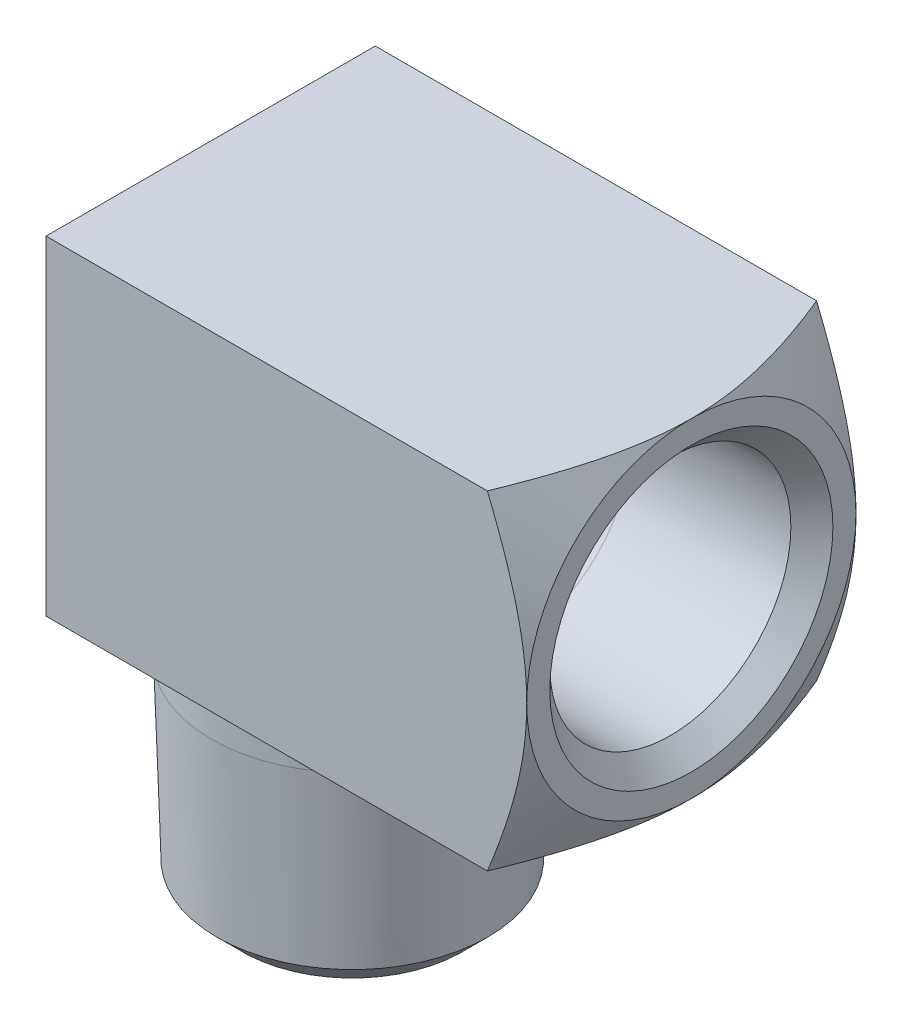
ISO-10303-21;
HEADER;
FILE_DESCRIPTION(('STEP AP214'),'2;1');
FILE_NAME('part.step','',(''),(''),'','','');
FILE_SCHEMA(('AUTOMOTIVE_DESIGN { 1 0 10303 214 1 1 1 1 }'));
ENDSEC;
DATA;
#1=APPLICATION_CONTEXT('core data for automotive mechanical design processes');
#2=APPLICATION_PROTOCOL_DEFINITION('international standard','automotive_design',2000,#1);
#3=PRODUCT_CONTEXT('',#1,'mechanical');
#4=PRODUCT('Part','Part','',(#3));
#5=PRODUCT_RELATED_PRODUCT_CATEGORY('part','',(#4));
#6=PRODUCT_DEFINITION_FORMATION('','',#4);
#7=PRODUCT_DEFINITION_CONTEXT('part definition',#1,'design');
#8=PRODUCT_DEFINITION('design','',#6,#7);
#9=PRODUCT_DEFINITION_SHAPE('','',#8);
#10=(LENGTH_UNIT() NAMED_UNIT(*) SI_UNIT(.MILLI.,.METRE.));
#11=(NAMED_UNIT(*) PLANE_ANGLE_UNIT() SI_UNIT($,.RADIAN.));
#12=(NAMED_UNIT(*) SI_UNIT($,.STERADIAN.) SOLID_ANGLE_UNIT());
#13=UNCERTAINTY_MEASURE_WITH_UNIT(LENGTH_MEASURE(1.E-05),#10,'distance_accuracy_value','');
#14=(GEOMETRIC_REPRESENTATION_CONTEXT(3) GLOBAL_UNCERTAINTY_ASSIGNED_CONTEXT((#13)) GLOBAL_UNIT_ASSIGNED_CONTEXT((#10,
#11,#12)) REPRESENTATION_CONTEXT('',''));
#15=CARTESIAN_POINT('',(0.,0.,0.));
#16=DIRECTION('',(0.,0.,1.));
#17=DIRECTION('',(1.,0.,0.));
#18=AXIS2_PLACEMENT_3D('',#15,#16,#17);
#19=CARTESIAN_POINT('',(0.,16.256,0.));
#20=DIRECTION('',(1.,0.,0.));
#21=DIRECTION('',(0.,0.,1.));
#22=AXIS2_PLACEMENT_3D('',#19,#20,#21);
#23=PLANE('',#22);
#24=CARTESIAN_POINT('',(0.,16.256,0.));
#25=DIRECTION('',(-1.,0.,0.));
#26=DIRECTION('',(0.,0.,-1.));
#27=AXIS2_PLACEMENT_3D('',#24,#25,#26);
#28=CIRCLE('',#27,7.112);
#29=CARTESIAN_POINT('',(-1.26950533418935E-10,16.2560000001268,-7.11199999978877));
#30=VERTEX_POINT('',#29);
#31=CARTESIAN_POINT('',(0.,16.256,7.112));
#32=VERTEX_POINT('',#31);
#33=EDGE_CURVE('E21',#30,#32,#28,.F.);
#34=ORIENTED_EDGE('',*,*,#33,.T.);
#35=DIRECTION('',(0.,0.515038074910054,-0.857167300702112));
#36=VECTOR('',#35,1.);
#37=CARTESIAN_POINT('',(0.,18.3926603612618,3.556));
#38=LINE('',#37,#36);
#39=CARTESIAN_POINT('',(0.,20.5293207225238,0.));
#40=VERTEX_POINT('',#39);
#41=EDGE_CURVE('E70',#32,#40,#38,.T.);
#42=ORIENTED_EDGE('',*,*,#41,.T.);
#43=DIRECTION('',(-3.05900708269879E-11,-0.515038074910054,-0.857167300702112));
#44=VECTOR('',#43,1.);
#45=CARTESIAN_POINT('',(-1.26912369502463E-10,18.3926603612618,-3.556));
#46=LINE('',#45,#44);
#47=EDGE_CURVE('E117',#40,#30,#46,.T.);
#48=ORIENTED_EDGE('',*,*,#47,.T.);
#49=EDGE_LOOP('',(#34,#42,#48));
#50=FACE_BOUND('',#49,.T.);
#51=ADVANCED_FACE('F17',(#50),#23,.T.);
#52=CARTESIAN_POINT('',(26.162,16.256,0.));
#53=DIRECTION('',(-1.,0.,0.));
#54=DIRECTION('',(0.,0.,-1.));
#55=AXIS2_PLACEMENT_3D('',#52,#53,#54);
#56=CYLINDRICAL_SURFACE('',#55,7.112);
#57=CARTESIAN_POINT('',(11.233658,16.256,0.));
#58=DIRECTION('',(-1.,0.,0.));
#59=DIRECTION('',(0.,0.,-1.));
#60=AXIS2_PLACEMENT_3D('',#57,#58,#59);
#61=CIRCLE('',#60,7.112);
#62=CARTESIAN_POINT('',(11.233658,16.256,-7.112));
#63=VERTEX_POINT('',#62);
#64=EDGE_CURVE('E156',#63,#63,#61,.F.);
#65=ORIENTED_EDGE('',*,*,#64,.T.);
#66=EDGE_LOOP('',(#65));
#67=FACE_BOUND('',#66,.T.);
#68=ORIENTED_EDGE('',*,*,#33,.F.);
#69=CARTESIAN_POINT('',(0.,16.256,0.));
#70=DIRECTION('',(-0.707106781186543,-0.707106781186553,0.));
#71=DIRECTION('',(-0.707106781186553,0.707106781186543,0.));
#72=AXIS2_PLACEMENT_3D('',#69,#70,#71);
#73=ELLIPSE('',#72,10.0578868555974,7.112);
#74=EDGE_CURVE('E152',#30,#32,#73,.T.);
#75=ORIENTED_EDGE('',*,*,#74,.T.);
#76=EDGE_LOOP('',(#68,#75));
#77=FACE_BOUND('',#76,.T.);
#78=ADVANCED_FACE('F269',(#67,#77),#56,.F.);
#79=CARTESIAN_POINT('',(0.,16.256,0.));
#80=DIRECTION('',(0.,-1.,0.));
#81=DIRECTION('',(0.,0.,1.));
#82=AXIS2_PLACEMENT_3D('',#79,#80,#81);
#83=CONICAL_SURFACE('',#82,7.112,1.02974425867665);
#84=ORIENTED_EDGE('',*,*,#41,.F.);
#85=CARTESIAN_POINT('',(0.,16.256,0.));
#86=DIRECTION('',(0.,-1.,0.));
#87=DIRECTION('',(0.,0.,1.));
#88=AXIS2_PLACEMENT_3D('',#85,#86,#87);
#89=CIRCLE('',#88,7.112);
#90=EDGE_CURVE('E148',#32,#30,#89,.T.);
#91=ORIENTED_EDGE('',*,*,#90,.T.);
#92=ORIENTED_EDGE('',*,*,#47,.F.);
#93=EDGE_LOOP('',(#84,#91,#92));
#94=FACE_BOUND('',#93,.T.);
#95=ADVANCED_FACE('F275',(#94),#83,.F.);
#96=CARTESIAN_POINT('',(11.2336580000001,7.3266299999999,9.1079574));
#97=DIRECTION('',(-1.,0.,0.));
#98=DIRECTION('',(0.,1.,0.));
#99=AXIS2_PLACEMENT_3D('',#96,#97,#98);
#100=PLANE('',#99);
#101=ORIENTED_EDGE('',*,*,#64,.F.);
#102=EDGE_LOOP('',(#101));
#103=FACE_BOUND('',#102,.T.);
#104=CARTESIAN_POINT('',(11.233658,16.256,0.));
#105=DIRECTION('',(-1.,0.,0.));
#106=DIRECTION('',(0.,0.,-1.));
#107=AXIS2_PLACEMENT_3D('',#104,#105,#106);
#108=CIRCLE('',#107,8.92937);
#109=CARTESIAN_POINT('',(11.233658,16.256,-8.92937));
#110=VERTEX_POINT('',#109);
#111=EDGE_CURVE('E151',#110,#110,#108,.F.);
#112=ORIENTED_EDGE('',*,*,#111,.T.);
#113=EDGE_LOOP('',(#112));
#114=FACE_BOUND('',#113,.T.);
#115=ADVANCED_FACE('F271',(#103,#114),#100,.F.);
#116=CARTESIAN_POINT('',(2.22044604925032E-13,-15.494,0.));
#117=DIRECTION('',(0.,1.,0.));
#118=DIRECTION('',(0.,0.,-1.));
#119=AXIS2_PLACEMENT_3D('',#116,#117,#118);
#120=CYLINDRICAL_SURFACE('',#119,7.112);
#121=CARTESIAN_POINT('',(2.22044604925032E-13,-15.494,0.));
#122=DIRECTION('',(0.,1.,0.));
#123=DIRECTION('',(0.,0.,-1.));
#124=AXIS2_PLACEMENT_3D('',#121,#122,#123);
#125=CIRCLE('',#124,7.112);
#126=CARTESIAN_POINT('',(2.22044604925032E-13,-15.494,-7.112));
#127=VERTEX_POINT('',#126);
#128=EDGE_CURVE('E147',#127,#127,#125,.T.);
#129=ORIENTED_EDGE('',*,*,#128,.F.);
#130=EDGE_LOOP('',(#129));
#131=FACE_BOUND('',#130,.T.);
#132=ORIENTED_EDGE('',*,*,#74,.F.);
#133=ORIENTED_EDGE('',*,*,#90,.F.);
#134=EDGE_LOOP('',(#132,#133));
#135=FACE_BOUND('',#134,.T.);
#136=ADVANCED_FACE('F274',(#131,#135),#120,.F.);
#137=CARTESIAN_POINT('',(12.59078,16.256,0.));
#138=DIRECTION('',(-1.,0.,0.));
#139=DIRECTION('',(0.,0.,-1.));
#140=AXIS2_PLACEMENT_3D('',#137,#138,#139);
#141=CYLINDRICAL_SURFACE('',#140,8.92937);
#142=ORIENTED_EDGE('',*,*,#111,.F.);
#143=EDGE_LOOP('',(#142));
#144=FACE_BOUND('',#143,.T.);
#145=CARTESIAN_POINT('',(12.5907799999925,16.256,0.));
#146=DIRECTION('',(1.,0.,0.));
#147=DIRECTION('',(0.,0.,-1.));
#148=AXIS2_PLACEMENT_3D('',#145,#146,#147);
#149=CIRCLE('',#148,8.9293700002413);
#150=CARTESIAN_POINT('',(12.5907799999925,16.256,-8.9293700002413));
#151=VERTEX_POINT('',#150);
#152=EDGE_CURVE('E144',#151,#151,#149,.T.);
#153=ORIENTED_EDGE('',*,*,#152,.T.);
#154=EDGE_LOOP('',(#153));
#155=FACE_BOUND('',#154,.T.);
#156=ADVANCED_FACE('F19',(#144,#155),#141,.F.);
#157=CARTESIAN_POINT('',(2.22044604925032E-13,-15.494,0.));
#158=DIRECTION('',(0.,-1.,0.));
#159=DIRECTION('',(0.,0.,1.));
#160=AXIS2_PLACEMENT_3D('',#157,#158,#159);
#161=PLANE('',#160);
#162=ORIENTED_EDGE('',*,*,#128,.T.);
#163=EDGE_LOOP('',(#162));
#164=FACE_BOUND('',#163,.T.);
#165=CARTESIAN_POINT('',(2.22044604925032E-13,-15.4940000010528,0.));
#166=DIRECTION('',(0.,1.,0.));
#167=DIRECTION('',(0.,0.,-1.));
#168=AXIS2_PLACEMENT_3D('',#165,#166,#167);
#169=CIRCLE('',#168,8.50900000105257);
#170=CARTESIAN_POINT('',(2.22044604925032E-13,-15.4940000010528,-8.50900000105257));
#171=VERTEX_POINT('',#170);
#172=EDGE_CURVE('E143',#171,#171,#169,.T.);
#173=ORIENTED_EDGE('',*,*,#172,.F.);
#174=EDGE_LOOP('',(#173));
#175=FACE_BOUND('',#174,.T.);
#176=ADVANCED_FACE('F281',(#164,#175),#161,.T.);
#177=CARTESIAN_POINT('',(24.5413835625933,16.256,0.));
#178=DIRECTION('',(1.,0.,0.));
#179=DIRECTION('',(0.,0.,1.));
#180=AXIS2_PLACEMENT_3D('',#177,#178,#179);
#181=CONICAL_SURFACE('',#180,9.30138356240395,0.0311192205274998);
#182=ORIENTED_EDGE('',*,*,#152,.F.);
#183=EDGE_LOOP('',(#182));
#184=FACE_BOUND('',#183,.T.);
#185=CARTESIAN_POINT('',(24.5413835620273,16.256,0.));
#186=DIRECTION('',(1.,0.,0.));
#187=DIRECTION('',(0.,0.,-1.));
#188=AXIS2_PLACEMENT_3D('',#185,#186,#187);
#189=CIRCLE('',#188,9.30138356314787);
#190=CARTESIAN_POINT('',(24.5413835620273,16.256,-9.30138356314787));
#191=VERTEX_POINT('',#190);
#192=EDGE_CURVE('E140',#191,#191,#189,.T.);
#193=ORIENTED_EDGE('',*,*,#192,.T.);
#194=EDGE_LOOP('',(#193));
#195=FACE_BOUND('',#194,.T.);
#196=ADVANCED_FACE('F284',(#184,#195),#181,.F.);
#197=CARTESIAN_POINT('',(2.08166817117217E-13,-13.566791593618,0.));
#198=DIRECTION('',(0.,1.,0.));
#199=DIRECTION('',(0.,0.,-1.));
#200=AXIS2_PLACEMENT_3D('',#197,#198,#199);
#201=CONICAL_SURFACE('',#200,10.4362084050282,0.7853981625);
#202=CARTESIAN_POINT('',(2.08166817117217E-13,-13.5667915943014,0.));
#203=DIRECTION('',(0.,1.,0.));
#204=DIRECTION('',(-1.,0.,0.));
#205=AXIS2_PLACEMENT_3D('',#202,#203,#204);
#206=CIRCLE('',#205,10.4362084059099);
#207=CARTESIAN_POINT('',(-10.4362084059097,-13.5667915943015,0.));
#208=VERTEX_POINT('',#207);
#209=EDGE_CURVE('E136',#208,#208,#206,.T.);
#210=ORIENTED_EDGE('',*,*,#209,.F.);
#211=EDGE_LOOP('',(#210));
#212=FACE_BOUND('',#211,.T.);
#213=ORIENTED_EDGE('',*,*,#172,.T.);
#214=EDGE_LOOP('',(#213));
#215=FACE_BOUND('',#214,.T.);
#216=ADVANCED_FACE('F287',(#212,#215),#201,.T.);
#217=CARTESIAN_POINT('',(26.1620000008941,16.256,0.));
#218=DIRECTION('',(1.,0.,0.));
#219=DIRECTION('',(0.,0.,1.));
#220=AXIS2_PLACEMENT_3D('',#217,#218,#219);
#221=CONICAL_SURFACE('',#220,10.9219999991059,0.785398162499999);
#222=ORIENTED_EDGE('',*,*,#192,.F.);
#223=EDGE_LOOP('',(#222));
#224=FACE_BOUND('',#223,.T.);
#225=CARTESIAN_POINT('',(26.1620000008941,16.256,0.));
#226=DIRECTION('',(1.,0.,0.));
#227=DIRECTION('',(0.,0.,1.));
#228=AXIS2_PLACEMENT_3D('',#225,#226,#227);
#229=CIRCLE('',#228,10.9219999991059);
#230=CARTESIAN_POINT('',(26.1620000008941,16.256,10.9219999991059));
#231=VERTEX_POINT('',#230);
#232=EDGE_CURVE('E139',#231,#231,#229,.T.);
#233=ORIENTED_EDGE('',*,*,#232,.T.);
#234=EDGE_LOOP('',(#233));
#235=FACE_BOUND('',#234,.T.);
#236=ADVANCED_FACE('F291',(#224,#235),#221,.F.);
#237=CARTESIAN_POINT('',(1.14491749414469E-13,-0.123443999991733,0.));
#238=DIRECTION('',(0.,1.,0.));
#239=DIRECTION('',(0.,0.,-1.));
#240=AXIS2_PLACEMENT_3D('',#237,#238,#239);
#241=CONICAL_SURFACE('',#240,10.8546899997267,0.0311192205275);
#242=CARTESIAN_POINT('',(1.14491749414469E-13,-0.123444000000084,0.));
#243=DIRECTION('',(0.,-1.,0.));
#244=DIRECTION('',(0.,0.,1.));
#245=AXIS2_PLACEMENT_3D('',#242,#243,#244);
#246=CIRCLE('',#245,10.85469);
#247=CARTESIAN_POINT('',(1.14491749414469E-13,-0.123444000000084,10.85469));
#248=VERTEX_POINT('',#247);
#249=EDGE_CURVE('E132',#248,#248,#246,.F.);
#250=ORIENTED_EDGE('',*,*,#249,.F.);
#251=EDGE_LOOP('',(#250));
#252=FACE_BOUND('',#251,.T.);
#253=ORIENTED_EDGE('',*,*,#209,.T.);
#254=EDGE_LOOP('',(#253));
#255=FACE_BOUND('',#254,.T.);
#256=ADVANCED_FACE('F294',(#252,#255),#241,.T.);
#257=CARTESIAN_POINT('',(26.162,16.256,0.));
#258=DIRECTION('',(-1.,0.,0.));
#259=DIRECTION('',(0.,0.,-1.));
#260=AXIS2_PLACEMENT_3D('',#257,#258,#259);
#261=PLANE('',#260);
#262=ORIENTED_EDGE('',*,*,#232,.F.);
#263=EDGE_LOOP('',(#262));
#264=FACE_BOUND('',#263,.T.);
#265=CARTESIAN_POINT('',(26.1620000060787,16.256,0.));
#266=DIRECTION('',(-1.,0.,0.));
#267=DIRECTION('',(0.,0.,-1.));
#268=AXIS2_PLACEMENT_3D('',#265,#266,#267);
#269=CIRCLE('',#268,12.7000000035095);
#270=CARTESIAN_POINT('',(26.162000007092,3.55599999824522,0.));
#271=VERTEX_POINT('',#270);
#272=CARTESIAN_POINT('',(26.1620000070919,16.256,12.7000000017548));
#273=VERTEX_POINT('',#272);
#274=EDGE_CURVE('E225',#271,#273,#269,.T.);
#275=ORIENTED_EDGE('',*,*,#274,.F.);
#276=CARTESIAN_POINT('',(26.1620000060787,16.256,0.));
#277=DIRECTION('',(-1.,0.,0.));
#278=DIRECTION('',(0.,0.,-1.));
#279=AXIS2_PLACEMENT_3D('',#276,#277,#278);
#280=CIRCLE('',#279,12.7000000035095);
#281=CARTESIAN_POINT('',(26.1620000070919,16.256,-12.7000000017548));
#282=VERTEX_POINT('',#281);
#283=EDGE_CURVE('E135',#282,#271,#280,.T.);
#284=ORIENTED_EDGE('',*,*,#283,.F.);
#285=CARTESIAN_POINT('',(26.1620000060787,16.256,0.));
#286=DIRECTION('',(-1.,0.,0.));
#287=DIRECTION('',(0.,0.,-1.));
#288=AXIS2_PLACEMENT_3D('',#285,#286,#287);
#289=CIRCLE('',#288,12.7000000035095);
#290=CARTESIAN_POINT('',(26.1620000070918,28.9560000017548,0.));
#291=VERTEX_POINT('',#290);
#292=EDGE_CURVE('E253',#291,#282,#289,.T.);
#293=ORIENTED_EDGE('',*,*,#292,.F.);
#294=CARTESIAN_POINT('',(26.1620000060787,16.256,0.));
#295=DIRECTION('',(-1.,0.,0.));
#296=DIRECTION('',(0.,0.,-1.));
#297=AXIS2_PLACEMENT_3D('',#294,#295,#296);
#298=CIRCLE('',#297,12.7000000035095);
#299=EDGE_CURVE('E206',#273,#291,#298,.T.);
#300=ORIENTED_EDGE('',*,*,#299,.F.);
#301=EDGE_LOOP('',(#275,#284,#293,#300));
#302=FACE_BOUND('',#301,.T.);
#303=ADVANCED_FACE('F213',(#264,#302),#261,.F.);
#304=CARTESIAN_POINT('',(23.1066189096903,16.256,0.));
#305=DIRECTION('',(-1.,0.,0.));
#306=DIRECTION('',(0.,0.,-1.));
#307=AXIS2_PLACEMENT_3D('',#304,#305,#306);
#308=CONICAL_SURFACE('',#307,17.9920752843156,1.04719755);
#309=CARTESIAN_POINT('',(26.1620000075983,28.9559999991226,0.));
#310=CARTESIAN_POINT('',(26.1620046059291,28.9559999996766,-0.183310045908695));
#311=CARTESIAN_POINT('',(26.1597079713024,28.9559999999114,-0.366612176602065));
#312=CARTESIAN_POINT('',(26.1505538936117,28.9560000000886,-0.733097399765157));
#313=CARTESIAN_POINT('',(26.1436965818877,28.9560000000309,-0.916280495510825));
#314=CARTESIAN_POINT('',(26.1163542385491,28.9559999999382,-1.46534509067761));
#315=CARTESIAN_POINT('',(26.0890987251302,28.9559999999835,-1.83090946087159));
#316=CARTESIAN_POINT('',(26.0174746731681,28.9560000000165,-2.55916985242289));
#317=CARTESIAN_POINT('',(25.9731599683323,28.9560000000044,-2.92187127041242));
#318=CARTESIAN_POINT('',(25.868658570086,28.9559999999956,-3.64499769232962));
#319=CARTESIAN_POINT('',(25.808470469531,28.9559999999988,-4.00542249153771));
#320=CARTESIAN_POINT('',(25.6744179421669,28.9560000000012,-4.71984524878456));
#321=CARTESIAN_POINT('',(25.6007012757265,28.9560000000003,-5.07387113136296));
#322=CARTESIAN_POINT('',(25.4407296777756,28.9559999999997,-5.7790486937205));
#323=CARTESIAN_POINT('',(25.3544748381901,28.9559999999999,-6.13020039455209));
#324=CARTESIAN_POINT('',(25.0790888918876,28.9560000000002,-7.17976561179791));
#325=CARTESIAN_POINT('',(24.8734185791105,28.956,-7.87387014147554));
#326=CARTESIAN_POINT('',(24.5385327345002,28.956,-8.91141551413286));
#327=CARTESIAN_POINT('',(24.4216369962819,28.956,-9.25896864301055));
#328=CARTESIAN_POINT('',(24.1804915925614,28.956,-9.95138472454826));
#329=CARTESIAN_POINT('',(24.0562446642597,28.956,-10.2962486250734));
#330=CARTESIAN_POINT('',(23.8006998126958,28.956,-10.9854770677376));
#331=CARTESIAN_POINT('',(23.6693671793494,28.956,-11.3298286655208));
#332=CARTESIAN_POINT('',(23.4010920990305,28.956,-12.0164464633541));
#333=CARTESIAN_POINT('',(23.2641481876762,28.956,-12.3587120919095));
#334=CARTESIAN_POINT('',(23.1248418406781,28.956,-12.699999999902));
#335=B_SPLINE_CURVE_WITH_KNOTS('',3,(#309,#310,#311,#312,#313,#314,#315,#316,#317,#318,#319,
#320,#321,#322,#323,#324,#325,#326,#327,#328,#329,#330,#331,#332,#333,#334),.UNSPECIFIED.,.F.,
.F.,(4,2,2,2,2,2,2,2,2,2,2,2,4),(0.,0.549900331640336,1.09978482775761,2.19905169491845,
3.29487767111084,4.39080082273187,5.47539858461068,6.55998839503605,8.7304468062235,
9.83045639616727,10.9300589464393,12.0356490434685,13.1415295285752),.UNSPECIFIED.);
#336=CARTESIAN_POINT('',(23.1248418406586,28.9559999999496,-12.7));
#337=VERTEX_POINT('',#336);
#338=EDGE_CURVE('E129',#291,#337,#335,.T.);
#339=ORIENTED_EDGE('',*,*,#338,.F.);
#340=ORIENTED_EDGE('',*,*,#292,.T.);
#341=CARTESIAN_POINT('',(23.1248418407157,28.9559999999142,-12.7000000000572));
#342=CARTESIAN_POINT('',(23.2284829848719,28.7021196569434,-12.7000000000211));
#343=CARTESIAN_POINT('',(23.3308012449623,28.447699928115,-12.7000000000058));
#344=CARTESIAN_POINT('',(23.532472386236,27.9376738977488,-12.6999999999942));
#345=CARTESIAN_POINT('',(23.6318251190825,27.6820675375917,-12.699999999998));
#346=CARTESIAN_POINT('',(23.9250334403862,26.9131003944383,-12.700000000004));
#347=CARTESIAN_POINT('',(24.1139396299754,26.3978336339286,-12.7000000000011));
#348=CARTESIAN_POINT('',(24.4735778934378,25.3664445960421,-12.6999999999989));
#349=CARTESIAN_POINT('',(24.6444654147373,24.8503768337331,-12.6999999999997));
#350=CARTESIAN_POINT('',(24.9661448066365,23.8119694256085,-12.7000000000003));
#351=CARTESIAN_POINT('',(25.1169372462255,23.2896299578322,-12.7000000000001));
#352=CARTESIAN_POINT('',(25.3944886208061,22.235493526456,-12.6999999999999));
#353=CARTESIAN_POINT('',(25.5211121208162,21.7036605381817,-12.7));
#354=CARTESIAN_POINT('',(25.7439499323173,20.6337185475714,-12.7));
#355=CARTESIAN_POINT('',(25.8401755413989,20.095611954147,-12.7));
#356=CARTESIAN_POINT('',(25.9582651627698,19.2821403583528,-12.7));
#357=CARTESIAN_POINT('',(25.9933533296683,19.0086601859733,-12.7));
#358=CARTESIAN_POINT('',(26.0539603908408,18.4606364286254,-12.7));
#359=CARTESIAN_POINT('',(26.0794795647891,18.1860928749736,-12.7));
#360=CARTESIAN_POINT('',(26.1205318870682,17.635838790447,-12.7));
#361=CARTESIAN_POINT('',(26.1360498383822,17.360127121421,-12.7));
#362=CARTESIAN_POINT('',(26.1568008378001,16.8082800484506,-12.7));
#363=CARTESIAN_POINT('',(26.1620324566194,16.5321445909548,-12.7));
#364=CARTESIAN_POINT('',(26.162000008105,16.2560000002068,-12.7));
#365=B_SPLINE_CURVE_WITH_KNOTS('',3,(#341,#342,#343,#344,#345,#346,#347,#348,#349,#350,#351,
#352,#353,#354,#355,#356,#357,#358,#359,#360,#361,#362,#363,#364),.UNSPECIFIED.,.F.,.F.,(4,2,2,
2,2,2,2,2,2,2,2,4),(0.,0.822653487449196,1.64534805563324,3.29152221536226,4.92207553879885,
6.55258268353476,8.19197440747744,9.83075612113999,10.6577807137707,11.4847811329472,
12.3130352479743,13.1414044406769),.UNSPECIFIED.);
#366=EDGE_CURVE('E220',#337,#282,#365,.T.);
#367=ORIENTED_EDGE('',*,*,#366,.F.);
#368=EDGE_LOOP('',(#339,#340,#367));
#369=FACE_BOUND('',#368,.T.);
#370=ADVANCED_FACE('F208',(#369),#308,.T.);
#371=CARTESIAN_POINT('',(23.1066189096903,16.256,0.));
#372=DIRECTION('',(-1.,0.,0.));
#373=DIRECTION('',(0.,0.,-1.));
#374=AXIS2_PLACEMENT_3D('',#371,#372,#373);
#375=CONICAL_SURFACE('',#374,17.9920752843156,1.04719755);
#376=CARTESIAN_POINT('',(26.1620000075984,16.256,-12.6999999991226));
#377=CARTESIAN_POINT('',(26.1620046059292,16.0726899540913,-12.6999999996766));
#378=CARTESIAN_POINT('',(26.1597079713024,15.8893878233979,-12.6999999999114));
#379=CARTESIAN_POINT('',(26.1505538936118,15.5229026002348,-12.7000000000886));
#380=CARTESIAN_POINT('',(26.1436965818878,15.3397195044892,-12.7000000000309));
#381=CARTESIAN_POINT('',(26.1163542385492,14.7906549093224,-12.6999999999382));
#382=CARTESIAN_POINT('',(26.0890987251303,14.4250905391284,-12.6999999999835));
#383=CARTESIAN_POINT('',(26.0174746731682,13.6968301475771,-12.7000000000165));
#384=CARTESIAN_POINT('',(25.9731599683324,13.3341287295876,-12.7000000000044));
#385=CARTESIAN_POINT('',(25.8686585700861,12.6110023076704,-12.6999999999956));
#386=CARTESIAN_POINT('',(25.8084704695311,12.2505775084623,-12.6999999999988));
#387=CARTESIAN_POINT('',(25.6744179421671,11.5361547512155,-12.7000000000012));
#388=CARTESIAN_POINT('',(25.6007012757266,11.182128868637,-12.7000000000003));
#389=CARTESIAN_POINT('',(25.4407296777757,10.4769513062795,-12.6999999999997));
#390=CARTESIAN_POINT('',(25.3544748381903,10.1257996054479,-12.6999999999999));
#391=CARTESIAN_POINT('',(25.0790888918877,9.07623438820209,-12.7000000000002));
#392=CARTESIAN_POINT('',(24.8734185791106,8.38212985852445,-12.7));
#393=CARTESIAN_POINT('',(24.5385327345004,7.34458448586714,-12.7));
#394=CARTESIAN_POINT('',(24.421636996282,6.99703135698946,-12.7));
#395=CARTESIAN_POINT('',(24.1804915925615,6.30461527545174,-12.7));
#396=CARTESIAN_POINT('',(24.0562446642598,5.95975137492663,-12.7));
#397=CARTESIAN_POINT('',(23.8006998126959,5.27052293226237,-12.7));
#398=CARTESIAN_POINT('',(23.6693671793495,4.92617133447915,-12.7));
#399=CARTESIAN_POINT('',(23.4010920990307,4.23955353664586,-12.7));
#400=CARTESIAN_POINT('',(23.2641481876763,3.89728790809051,-12.7));
#401=CARTESIAN_POINT('',(23.1248418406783,3.55600000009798,-12.7));
#402=B_SPLINE_CURVE_WITH_KNOTS('',3,(#376,#377,#378,#379,#380,#381,#382,#383,#384,#385,#386,
#387,#388,#389,#390,#391,#392,#393,#394,#395,#396,#397,#398,#399,#400,#401),.UNSPECIFIED.,.F.,
.F.,(4,2,2,2,2,2,2,2,2,2,2,2,4),(0.,0.549900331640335,1.09978482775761,2.19905169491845,
3.29487767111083,4.39080082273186,5.47539858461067,6.55998839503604,8.73044680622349,
9.83045639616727,10.9300589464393,12.0356490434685,13.1415295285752),.UNSPECIFIED.);
#403=CARTESIAN_POINT('',(23.1248418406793,3.55600000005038,-12.6999999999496));
#404=VERTEX_POINT('',#403);
#405=EDGE_CURVE('E95',#282,#404,#402,.T.);
#406=ORIENTED_EDGE('',*,*,#405,.F.);
#407=ORIENTED_EDGE('',*,*,#283,.T.);
#408=CARTESIAN_POINT('',(23.124841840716,3.55599999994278,-12.6999999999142));
#409=CARTESIAN_POINT('',(23.2284829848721,3.5559999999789,-12.4461196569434));
#410=CARTESIAN_POINT('',(23.3308012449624,3.55599999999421,-12.191699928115));
#411=CARTESIAN_POINT('',(23.5324723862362,3.55600000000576,-11.6816738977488));
#412=CARTESIAN_POINT('',(23.6318251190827,3.556000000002,-11.4260675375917));
#413=CARTESIAN_POINT('',(23.9250334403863,3.55599999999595,-10.6571003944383));
#414=CARTESIAN_POINT('',(24.1139396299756,3.55599999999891,-10.1418336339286));
#415=CARTESIAN_POINT('',(24.473577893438,3.55600000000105,-9.11044459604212));
#416=CARTESIAN_POINT('',(24.6444654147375,3.55600000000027,-8.59437683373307));
#417=CARTESIAN_POINT('',(24.9661448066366,3.55599999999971,-7.55596942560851));
#418=CARTESIAN_POINT('',(25.1169372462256,3.55599999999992,-7.03362995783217));
#419=CARTESIAN_POINT('',(25.3944886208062,3.55600000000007,-5.97949352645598));
#420=CARTESIAN_POINT('',(25.5211121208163,3.55600000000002,-5.44766053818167));
#421=CARTESIAN_POINT('',(25.7439499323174,3.55599999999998,-4.37771854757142));
#422=CARTESIAN_POINT('',(25.840175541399,3.55599999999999,-3.83961195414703));
#423=CARTESIAN_POINT('',(25.9582651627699,3.556,-3.02614035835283));
#424=CARTESIAN_POINT('',(25.9933533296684,3.556,-2.75266018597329));
#425=CARTESIAN_POINT('',(26.0539603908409,3.556,-2.20463642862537));
#426=CARTESIAN_POINT('',(26.0794795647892,3.556,-1.93009287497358));
#427=CARTESIAN_POINT('',(26.1205318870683,3.556,-1.37983879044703));
#428=CARTESIAN_POINT('',(26.1360498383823,3.556,-1.10412712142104));
#429=CARTESIAN_POINT('',(26.1568008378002,3.556,-0.552280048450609));
#430=CARTESIAN_POINT('',(26.1620324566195,3.556,-0.276144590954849));
#431=CARTESIAN_POINT('',(26.1620000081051,3.556,-2.06802635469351E-10));
#432=B_SPLINE_CURVE_WITH_KNOTS('',3,(#408,#409,#410,#411,#412,#413,#414,#415,#416,#417,#418,
#419,#420,#421,#422,#423,#424,#425,#426,#427,#428,#429,#430,#431),.UNSPECIFIED.,.F.,.F.,(4,2,2,
2,2,2,2,2,2,2,2,4),(0.,0.822653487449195,1.64534805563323,3.29152221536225,4.92207553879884,
6.55258268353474,8.19197440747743,9.83075612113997,10.6577807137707,11.4847811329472,
12.3130352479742,13.1414044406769),.UNSPECIFIED.);
#433=EDGE_CURVE('E194',#404,#271,#432,.T.);
#434=ORIENTED_EDGE('',*,*,#433,.F.);
#435=EDGE_LOOP('',(#406,#407,#434));
#436=FACE_BOUND('',#435,.T.);
#437=ADVANCED_FACE('F212',(#436),#375,.T.);
#438=CARTESIAN_POINT('',(0.,3.55599999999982,0.));
#439=DIRECTION('',(0.,-1.,0.));
#440=DIRECTION('',(0.,0.,1.));
#441=AXIS2_PLACEMENT_3D('',#438,#439,#440);
#442=CYLINDRICAL_SURFACE('',#441,10.85469);
#443=ORIENTED_EDGE('',*,*,#249,.T.);
#444=EDGE_LOOP('',(#443));
#445=FACE_BOUND('',#444,.T.);
#446=CARTESIAN_POINT('',(0.,3.55599999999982,0.));
#447=DIRECTION('',(0.,-1.,0.));
#448=DIRECTION('',(0.,0.,1.));
#449=AXIS2_PLACEMENT_3D('',#446,#447,#448);
#450=CIRCLE('',#449,10.85469);
#451=CARTESIAN_POINT('',(0.,3.55599999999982,10.85469));
#452=VERTEX_POINT('',#451);
#453=EDGE_CURVE('E99',#452,#452,#450,.F.);
#454=ORIENTED_EDGE('',*,*,#453,.F.);
#455=EDGE_LOOP('',(#454));
#456=FACE_BOUND('',#455,.T.);
#457=ADVANCED_FACE('F232',(#445,#456),#442,.T.);
#458=CARTESIAN_POINT('',(26.162,3.556,-12.7));
#459=DIRECTION('',(0.,0.,-1.));
#460=DIRECTION('',(1.,0.,0.));
#461=AXIS2_PLACEMENT_3D('',#458,#459,#460);
#462=PLANE('',#461);
#463=DIRECTION('',(-1.,0.,0.));
#464=VECTOR('',#463,1.);
#465=CARTESIAN_POINT('',(26.162,28.956,-12.7));
#466=LINE('',#465,#464);
#467=CARTESIAN_POINT('',(-10.922,28.956,-12.7));
#468=VERTEX_POINT('',#467);
#469=EDGE_CURVE('E127',#337,#468,#466,.T.);
#470=ORIENTED_EDGE('',*,*,#469,.F.);
#471=ORIENTED_EDGE('',*,*,#366,.T.);
#472=ORIENTED_EDGE('',*,*,#405,.T.);
#473=DIRECTION('',(-1.,0.,0.));
#474=VECTOR('',#473,1.);
#475=CARTESIAN_POINT('',(26.162,3.556,-12.7));
#476=LINE('',#475,#474);
#477=CARTESIAN_POINT('',(-10.922,3.55599999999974,-12.7));
#478=VERTEX_POINT('',#477);
#479=EDGE_CURVE('E87',#478,#404,#476,.F.);
#480=ORIENTED_EDGE('',*,*,#479,.F.);
#481=DIRECTION('',(0.,-1.,0.));
#482=VECTOR('',#481,1.);
#483=CARTESIAN_POINT('',(-10.922,28.956,-12.7));
#484=LINE('',#483,#482);
#485=EDGE_CURVE('E92',#468,#478,#484,.T.);
#486=ORIENTED_EDGE('',*,*,#485,.F.);
#487=EDGE_LOOP('',(#470,#471,#472,#480,#486));
#488=FACE_BOUND('',#487,.T.);
#489=ADVANCED_FACE('F90',(#488),#462,.T.);
#490=CARTESIAN_POINT('',(23.1066189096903,16.256,0.));
#491=DIRECTION('',(-1.,0.,0.));
#492=DIRECTION('',(0.,0.,-1.));
#493=AXIS2_PLACEMENT_3D('',#490,#491,#492);
#494=CONICAL_SURFACE('',#493,17.9920752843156,1.04719755);
#495=ORIENTED_EDGE('',*,*,#274,.T.);
#496=CARTESIAN_POINT('',(23.124841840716,3.55600000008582,12.7000000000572));
#497=CARTESIAN_POINT('',(23.2284829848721,3.80988034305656,12.7000000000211));
#498=CARTESIAN_POINT('',(23.3308012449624,4.06430007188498,12.7000000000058));
#499=CARTESIAN_POINT('',(23.5324723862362,4.5743261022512,12.6999999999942));
#500=CARTESIAN_POINT('',(23.6318251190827,4.82993246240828,12.699999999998));
#501=CARTESIAN_POINT('',(23.9250334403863,5.59889960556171,12.700000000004));
#502=CARTESIAN_POINT('',(24.1139396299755,6.11416636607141,12.7000000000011));
#503=CARTESIAN_POINT('',(24.4735778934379,7.14555540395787,12.6999999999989));
#504=CARTESIAN_POINT('',(24.6444654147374,7.66162316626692,12.6999999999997));
#505=CARTESIAN_POINT('',(24.9661448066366,8.70003057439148,12.7000000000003));
#506=CARTESIAN_POINT('',(25.1169372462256,9.22237004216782,12.7000000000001));
#507=CARTESIAN_POINT('',(25.3944886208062,10.276506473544,12.6999999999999));
#508=CARTESIAN_POINT('',(25.5211121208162,10.8083394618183,12.7));
#509=CARTESIAN_POINT('',(25.7439499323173,11.8782814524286,12.7));
#510=CARTESIAN_POINT('',(25.8401755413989,12.416388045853,12.7));
#511=CARTESIAN_POINT('',(25.9582651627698,13.2298596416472,12.7));
#512=CARTESIAN_POINT('',(25.9933533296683,13.5033398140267,12.7));
#513=CARTESIAN_POINT('',(26.0539603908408,14.0513635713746,12.7));
#514=CARTESIAN_POINT('',(26.0794795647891,14.3259071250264,12.7));
#515=CARTESIAN_POINT('',(26.1205318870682,14.876161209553,12.7));
#516=CARTESIAN_POINT('',(26.1360498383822,15.151872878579,12.7));
#517=CARTESIAN_POINT('',(26.1568008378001,15.7037199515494,12.7));
#518=CARTESIAN_POINT('',(26.1620324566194,15.9798554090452,12.7));
#519=CARTESIAN_POINT('',(26.162000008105,16.2559999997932,12.7));
#520=B_SPLINE_CURVE_WITH_KNOTS('',3,(#496,#497,#498,#499,#500,#501,#502,#503,#504,#505,#506,
#507,#508,#509,#510,#511,#512,#513,#514,#515,#516,#517,#518,#519),.UNSPECIFIED.,.F.,.F.,(4,2,2,
2,2,2,2,2,2,2,2,4),(0.,0.822653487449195,1.64534805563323,3.29152221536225,4.92207553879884,
6.55258268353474,8.19197440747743,9.83075612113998,10.6577807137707,11.4847811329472,
12.3130352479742,13.1414044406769),.UNSPECIFIED.);
#521=CARTESIAN_POINT('',(23.1248418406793,3.55600000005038,12.6999999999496));
#522=VERTEX_POINT('',#521);
#523=EDGE_CURVE('E98',#522,#273,#520,.T.);
#524=ORIENTED_EDGE('',*,*,#523,.F.);
#525=CARTESIAN_POINT('',(26.1620000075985,3.55600000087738,0.));
#526=CARTESIAN_POINT('',(26.1620046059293,3.55600000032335,0.183310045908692));
#527=CARTESIAN_POINT('',(26.1597079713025,3.55600000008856,0.366612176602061));
#528=CARTESIAN_POINT('',(26.1505538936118,3.55599999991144,0.733097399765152));
#529=CARTESIAN_POINT('',(26.1436965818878,3.55599999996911,0.916280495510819));
#530=CARTESIAN_POINT('',(26.1163542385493,3.55600000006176,1.46534509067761));
#531=CARTESIAN_POINT('',(26.0890987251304,3.55600000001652,1.83090946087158));
#532=CARTESIAN_POINT('',(26.0174746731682,3.55599999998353,2.55916985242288));
#533=CARTESIAN_POINT('',(25.9731599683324,3.55599999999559,2.92187127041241));
#534=CARTESIAN_POINT('',(25.8686585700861,3.55600000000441,3.64499769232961));
#535=CARTESIAN_POINT('',(25.8084704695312,3.55600000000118,4.0054224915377));
#536=CARTESIAN_POINT('',(25.6744179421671,3.55599999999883,4.71984524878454));
#537=CARTESIAN_POINT('',(25.6007012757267,3.55599999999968,5.07387113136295));
#538=CARTESIAN_POINT('',(25.4407296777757,3.55600000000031,5.77904869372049));
#539=CARTESIAN_POINT('',(25.3544748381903,3.5560000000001,6.13020039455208));
#540=CARTESIAN_POINT('',(25.0790888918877,3.55599999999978,7.1797656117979));
#541=CARTESIAN_POINT('',(24.8734185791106,3.55599999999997,7.87387014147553));
#542=CARTESIAN_POINT('',(24.5385327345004,3.55600000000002,8.91141551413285));
#543=CARTESIAN_POINT('',(24.421636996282,3.556,9.25896864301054));
#544=CARTESIAN_POINT('',(24.1804915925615,3.55599999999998,9.95138472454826));
#545=CARTESIAN_POINT('',(24.0562446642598,3.55599999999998,10.2962486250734));
#546=CARTESIAN_POINT('',(23.8006998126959,3.55599999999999,10.9854770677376));
#547=CARTESIAN_POINT('',(23.6693671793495,3.55599999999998,11.3298286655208));
#548=CARTESIAN_POINT('',(23.4010920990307,3.55599999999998,12.0164464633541));
#549=CARTESIAN_POINT('',(23.2641481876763,3.55599999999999,12.3587120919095));
#550=CARTESIAN_POINT('',(23.1248418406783,3.556,12.699999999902));
#551=B_SPLINE_CURVE_WITH_KNOTS('',3,(#525,#526,#527,#528,#529,#530,#531,#532,#533,#534,#535,
#536,#537,#538,#539,#540,#541,#542,#543,#544,#545,#546,#547,#548,#549,#550),.UNSPECIFIED.,.F.,
.F.,(4,2,2,2,2,2,2,2,2,2,2,2,4),(0.,0.549900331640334,1.09978482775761,2.19905169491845,
3.29487767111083,4.39080082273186,5.47539858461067,6.55998839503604,8.7304468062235,
9.83045639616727,10.9300589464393,12.0356490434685,13.1415295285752),.UNSPECIFIED.);
#552=EDGE_CURVE('E303',#271,#522,#551,.T.);
#553=ORIENTED_EDGE('',*,*,#552,.F.);
#554=EDGE_LOOP('',(#495,#524,#553));
#555=FACE_BOUND('',#554,.T.);
#556=ADVANCED_FACE('F183',(#555),#494,.T.);
#557=CARTESIAN_POINT('',(23.1066189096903,16.256,0.));
#558=DIRECTION('',(-1.,0.,0.));
#559=DIRECTION('',(0.,0.,-1.));
#560=AXIS2_PLACEMENT_3D('',#557,#558,#559);
#561=CONICAL_SURFACE('',#560,17.9920752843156,1.04719755);
#562=ORIENTED_EDGE('',*,*,#299,.T.);
#563=CARTESIAN_POINT('',(23.1248418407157,28.9560000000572,12.6999999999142));
#564=CARTESIAN_POINT('',(23.2284829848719,28.9560000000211,12.4461196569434));
#565=CARTESIAN_POINT('',(23.3308012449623,28.9560000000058,12.191699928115));
#566=CARTESIAN_POINT('',(23.532472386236,28.9559999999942,11.6816738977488));
#567=CARTESIAN_POINT('',(23.6318251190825,28.955999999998,11.4260675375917));
#568=CARTESIAN_POINT('',(23.9250334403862,28.956000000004,10.6571003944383));
#569=CARTESIAN_POINT('',(24.1139396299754,28.9560000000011,10.1418336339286));
#570=CARTESIAN_POINT('',(24.4735778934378,28.9559999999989,9.11044459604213));
#571=CARTESIAN_POINT('',(24.6444654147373,28.9559999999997,8.59437683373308));
#572=CARTESIAN_POINT('',(24.9661448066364,28.9560000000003,7.55596942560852));
#573=CARTESIAN_POINT('',(25.1169372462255,28.9560000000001,7.03362995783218));
#574=CARTESIAN_POINT('',(25.3944886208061,28.9559999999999,5.97949352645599));
#575=CARTESIAN_POINT('',(25.5211121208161,28.956,5.44766053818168));
#576=CARTESIAN_POINT('',(25.7439499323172,28.956,4.37771854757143));
#577=CARTESIAN_POINT('',(25.8401755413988,28.956,3.83961195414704));
#578=CARTESIAN_POINT('',(25.9582651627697,28.956,3.02614035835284));
#579=CARTESIAN_POINT('',(25.9933533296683,28.956,2.7526601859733));
#580=CARTESIAN_POINT('',(26.0539603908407,28.956,2.20463642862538));
#581=CARTESIAN_POINT('',(26.079479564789,28.956,1.93009287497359));
#582=CARTESIAN_POINT('',(26.1205318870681,28.956,1.37983879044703));
#583=CARTESIAN_POINT('',(26.1360498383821,28.956,1.10412712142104));
#584=CARTESIAN_POINT('',(26.1568008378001,28.956,0.552280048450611));
#585=CARTESIAN_POINT('',(26.1620324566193,28.956,0.276144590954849));
#586=CARTESIAN_POINT('',(26.1620000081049,28.956,2.06801863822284E-10));
#587=B_SPLINE_CURVE_WITH_KNOTS('',3,(#563,#564,#565,#566,#567,#568,#569,#570,#571,#572,#573,
#574,#575,#576,#577,#578,#579,#580,#581,#582,#583,#584,#585,#586),.UNSPECIFIED.,.F.,.F.,(4,2,2,
2,2,2,2,2,2,2,2,4),(0.,0.822653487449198,1.64534805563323,3.29152221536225,4.92207553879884,
6.55258268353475,8.19197440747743,9.83075612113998,10.6577807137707,11.4847811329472,
12.3130352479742,13.1414044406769),.UNSPECIFIED.);
#588=CARTESIAN_POINT('',(23.1248418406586,28.956,12.6999999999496));
#589=VERTEX_POINT('',#588);
#590=EDGE_CURVE('E36',#589,#291,#587,.T.);
#591=ORIENTED_EDGE('',*,*,#590,.F.);
#592=CARTESIAN_POINT('',(26.1620000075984,16.256,12.6999999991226));
#593=CARTESIAN_POINT('',(26.1620046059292,16.4393100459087,12.6999999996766));
#594=CARTESIAN_POINT('',(26.1597079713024,16.6226121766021,12.6999999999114));
#595=CARTESIAN_POINT('',(26.1505538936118,16.9890973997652,12.7000000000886));
#596=CARTESIAN_POINT('',(26.1436965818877,17.1722804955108,12.7000000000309));
#597=CARTESIAN_POINT('',(26.1163542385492,17.7213450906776,12.6999999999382));
#598=CARTESIAN_POINT('',(26.0890987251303,18.0869094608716,12.6999999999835));
#599=CARTESIAN_POINT('',(26.0174746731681,18.8151698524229,12.7000000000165));
#600=CARTESIAN_POINT('',(25.9731599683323,19.1778712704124,12.7000000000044));
#601=CARTESIAN_POINT('',(25.868658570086,19.9009976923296,12.6999999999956));
#602=CARTESIAN_POINT('',(25.8084704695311,20.2614224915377,12.6999999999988));
#603=CARTESIAN_POINT('',(25.674417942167,20.9758452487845,12.7000000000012));
#604=CARTESIAN_POINT('',(25.6007012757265,21.3298711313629,12.7000000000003));
#605=CARTESIAN_POINT('',(25.4407296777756,22.0350486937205,12.6999999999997));
#606=CARTESIAN_POINT('',(25.3544748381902,22.3862003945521,12.6999999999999));
#607=CARTESIAN_POINT('',(25.0790888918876,23.4357656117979,12.7000000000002));
#608=CARTESIAN_POINT('',(24.8734185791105,24.1298701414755,12.7));
#609=CARTESIAN_POINT('',(24.5385327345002,25.1674155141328,12.7));
#610=CARTESIAN_POINT('',(24.4216369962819,25.5149686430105,12.7));
#611=CARTESIAN_POINT('',(24.1804915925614,26.2073847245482,12.7));
#612=CARTESIAN_POINT('',(24.0562446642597,26.5522486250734,12.7));
#613=CARTESIAN_POINT('',(23.8006998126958,27.2414770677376,12.7));
#614=CARTESIAN_POINT('',(23.6693671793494,27.5858286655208,12.7));
#615=CARTESIAN_POINT('',(23.4010920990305,28.2724464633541,12.7));
#616=CARTESIAN_POINT('',(23.2641481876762,28.6147120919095,12.7));
#617=CARTESIAN_POINT('',(23.1248418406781,28.955999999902,12.7));
#618=B_SPLINE_CURVE_WITH_KNOTS('',3,(#592,#593,#594,#595,#596,#597,#598,#599,#600,#601,#602,
#603,#604,#605,#606,#607,#608,#609,#610,#611,#612,#613,#614,#615,#616,#617),.UNSPECIFIED.,.F.,
.F.,(4,2,2,2,2,2,2,2,2,2,2,2,4),(0.,0.549900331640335,1.09978482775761,2.19905169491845,
3.29487767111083,4.39080082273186,5.47539858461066,6.55998839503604,8.73044680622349,
9.83045639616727,10.9300589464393,12.0356490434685,13.1415295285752),.UNSPECIFIED.);
#619=EDGE_CURVE('E122',#273,#589,#618,.T.);
#620=ORIENTED_EDGE('',*,*,#619,.F.);
#621=EDGE_LOOP('',(#562,#591,#620));
#622=FACE_BOUND('',#621,.T.);
#623=ADVANCED_FACE('F178',(#622),#561,.T.);
#624=CARTESIAN_POINT('',(26.162,28.956,-12.7));
#625=DIRECTION('',(0.,1.,0.));
#626=DIRECTION('',(0.,0.,-1.));
#627=AXIS2_PLACEMENT_3D('',#624,#625,#626);
#628=PLANE('',#627);
#629=DIRECTION('',(-1.,0.,0.));
#630=VECTOR('',#629,1.);
#631=CARTESIAN_POINT('',(26.162,28.956,12.7));
#632=LINE('',#631,#630);
#633=CARTESIAN_POINT('',(-10.922,28.956,12.7));
#634=VERTEX_POINT('',#633);
#635=EDGE_CURVE('E27',#589,#634,#632,.T.);
#636=ORIENTED_EDGE('',*,*,#635,.F.);
#637=ORIENTED_EDGE('',*,*,#590,.T.);
#638=ORIENTED_EDGE('',*,*,#338,.T.);
#639=ORIENTED_EDGE('',*,*,#469,.T.);
#640=DIRECTION('',(0.,0.,-1.));
#641=VECTOR('',#640,1.);
#642=CARTESIAN_POINT('',(-10.922,28.956,12.7));
#643=LINE('',#642,#641);
#644=EDGE_CURVE('E113',#634,#468,#643,.T.);
#645=ORIENTED_EDGE('',*,*,#644,.F.);
#646=EDGE_LOOP('',(#636,#637,#638,#639,#645));
#647=FACE_BOUND('',#646,.T.);
#648=ADVANCED_FACE('F182',(#647),#628,.T.);
#649=CARTESIAN_POINT('',(26.162,3.556,12.7));
#650=DIRECTION('',(0.,-1.,0.));
#651=DIRECTION('',(0.,0.,1.));
#652=AXIS2_PLACEMENT_3D('',#649,#650,#651);
#653=PLANE('',#652);
#654=ORIENTED_EDGE('',*,*,#453,.T.);
#655=EDGE_LOOP('',(#654));
#656=FACE_BOUND('',#655,.T.);
#657=DIRECTION('',(-1.,0.,0.));
#658=VECTOR('',#657,1.);
#659=CARTESIAN_POINT('',(26.162,3.556,12.7));
#660=LINE('',#659,#658);
#661=CARTESIAN_POINT('',(-10.922,3.55599999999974,12.7));
#662=VERTEX_POINT('',#661);
#663=EDGE_CURVE('E11',#662,#522,#660,.F.);
#664=ORIENTED_EDGE('',*,*,#663,.F.);
#665=DIRECTION('',(0.,0.,1.));
#666=VECTOR('',#665,1.);
#667=CARTESIAN_POINT('',(-10.922,3.55599999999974,-12.7));
#668=LINE('',#667,#666);
#669=EDGE_CURVE('E102',#478,#662,#668,.T.);
#670=ORIENTED_EDGE('',*,*,#669,.F.);
#671=ORIENTED_EDGE('',*,*,#479,.T.);
#672=ORIENTED_EDGE('',*,*,#433,.T.);
#673=ORIENTED_EDGE('',*,*,#552,.T.);
#674=EDGE_LOOP('',(#664,#670,#671,#672,#673));
#675=FACE_BOUND('',#674,.T.);
#676=ADVANCED_FACE('F103',(#656,#675),#653,.T.);
#677=CARTESIAN_POINT('',(26.162,28.956,12.7));
#678=DIRECTION('',(0.,0.,1.));
#679=DIRECTION('',(-1.,0.,0.));
#680=AXIS2_PLACEMENT_3D('',#677,#678,#679);
#681=PLANE('',#680);
#682=ORIENTED_EDGE('',*,*,#635,.T.);
#683=DIRECTION('',(0.,1.,0.));
#684=VECTOR('',#683,1.);
#685=CARTESIAN_POINT('',(-10.922,3.55599999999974,12.7));
#686=LINE('',#685,#684);
#687=EDGE_CURVE('E108',#662,#634,#686,.T.);
#688=ORIENTED_EDGE('',*,*,#687,.F.);
#689=ORIENTED_EDGE('',*,*,#663,.T.);
#690=ORIENTED_EDGE('',*,*,#523,.T.);
#691=ORIENTED_EDGE('',*,*,#619,.T.);
#692=EDGE_LOOP('',(#682,#688,#689,#690,#691));
#693=FACE_BOUND('',#692,.T.);
#694=ADVANCED_FACE('F174',(#693),#681,.T.);
#695=CARTESIAN_POINT('',(-10.922,0.,0.));
#696=DIRECTION('',(-1.,0.,0.));
#697=DIRECTION('',(0.,-1.,0.));
#698=AXIS2_PLACEMENT_3D('',#695,#696,#697);
#699=PLANE('',#698);
#700=ORIENTED_EDGE('',*,*,#485,.T.);
#701=ORIENTED_EDGE('',*,*,#669,.T.);
#702=ORIENTED_EDGE('',*,*,#687,.T.);
#703=ORIENTED_EDGE('',*,*,#644,.T.);
#704=EDGE_LOOP('',(#700,#701,#702,#703));
#705=FACE_BOUND('',#704,.T.);
#706=ADVANCED_FACE('F111',(#705),#699,.T.);
#707=CLOSED_SHELL('',(#51,#78,#95,#115,#136,#156,#176,#196,#216,#236,#256,#303,#370,#437,#457,
#489,#556,#623,#648,#676,#694,#706));
#708=MANIFOLD_SOLID_BREP('B1',#707);
#709=ADVANCED_BREP_SHAPE_REPRESENTATION('',(#18,#708),#14);
#710=SHAPE_DEFINITION_REPRESENTATION(#9,#709);
ENDSEC;
END-ISO-10303-21;
